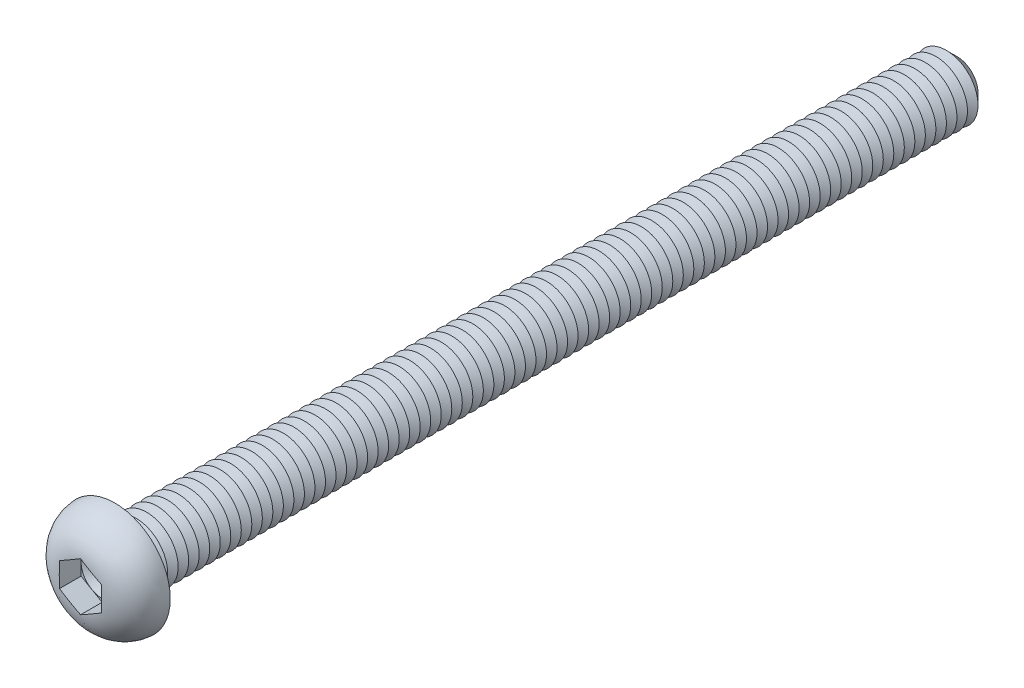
from build123d import *

# Parameters (mm, degrees)
CUT_EXTRUDE1_DEPTH  = 2.08
SKETCH4_R           = 3
BOSS_EXTRUDE1_DEPTH = 80
CHAMFER1_SIZE       = 1
LPATTERN1_COUNT     = 78
LPATTERN1_PITCH     = 1
FILLET2_R           = 0.4


with BuildPart() as part:
    # Sketch2 → Revolve1 (revolve)
    with BuildSketch(Plane(origin=(0, 0, 0), x_dir=(0, 0, -1), z_dir=(1, 0, 0)), mode=Mode.PRIVATE) as revolve1_sk:
        with BuildLine():
            Line((0, 0), (-3.3, 0))
            Line((-3.3, 0), (-3.3, 1.851470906))
            ThreePointArc((-3.3, 1.851470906), (-2.339262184, 4.220014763), (0, 5.25))
            Line((0, 5.25), (0, 0))
        make_face()
    revolve(revolve1_sk.sketch.rotate(Axis((0, 0, 47.934239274), (0, 0, -1)), 90), axis=Axis((0, 0, 47.934239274), (0, 0, -1)))

    # Sketch3 → Cut-Extrude1 (cut)
    with BuildSketch(Plane.XY.offset(3.3)):
        Polygon((0, 2.309401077), (-2, 1.154700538), (-2, -1.154700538), (0, -2.309401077), (2, -1.154700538), (2, 1.154700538), align=None)
    extrude(amount=-CUT_EXTRUDE1_DEPTH, mode=Mode.SUBTRACT)

    # Sketch4 → Boss-Extrude1 (add)
    with BuildSketch(Plane(origin=(0, 0, 0), x_dir=(-1, 0, 0), z_dir=(0, 0, -1))):
        Circle(SKETCH4_R)
    extrude(amount=BOSS_EXTRUDE1_DEPTH)

    # Chamfer1
    chamfer1_edges = [part.edges().sort_by_distance(p)[0] for p in [
        (3, 0, -80),
    ]]
    chamfer(chamfer1_edges, length=CHAMFER1_SIZE)

    # Sketch5 → Cut-Revolve1 (revolve, cut)
    with BuildSketch(Plane(origin=(0, 0, 0), x_dir=(0, 0, -1), z_dir=(1, 0, 0)), mode=Mode.PRIVATE) as cut_revolve1_sk:
        Polygon((1, 3), (2, 3), (1.5, 2.133974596), align=None)
    cut_revolve1 = revolve(cut_revolve1_sk.sketch.rotate(Axis((0, 0, 47.934239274), (0, 0, -1)), 90), axis=Axis((0, 0, 47.934239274), (0, 0, -1)), mode=Mode.SUBTRACT)

    # LPattern1: Cut-Revolve1 ×78
    with Locations(*[(0, 0, -i * LPATTERN1_PITCH) for i in range(1, LPATTERN1_COUNT)]):
        add(cut_revolve1, mode=Mode.SUBTRACT)

    # Fillet2
    fillet2_edges = [part.edges().sort_by_distance(p)[0] for p in [
        (3, 0, 0),
    ]]
    fillet(fillet2_edges, radius=FILLET2_R)

    # Cut-Extrude2 cone 1 section (on through the dimple's axis) → Cut-Extrude2 (revolve, cut)
    with BuildSketch(Plane(origin=(0, 0, 1.22), x_dir=(0, -1, 0), z_dir=(1, 0, 0))):
        Polygon((0, 0), (2, 0), (0, 1.154700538), align=None)
    revolve(axis=Axis((0, 0, 1.22), (0, 0, -1)), mode=Mode.SUBTRACT)


solid = part.part
